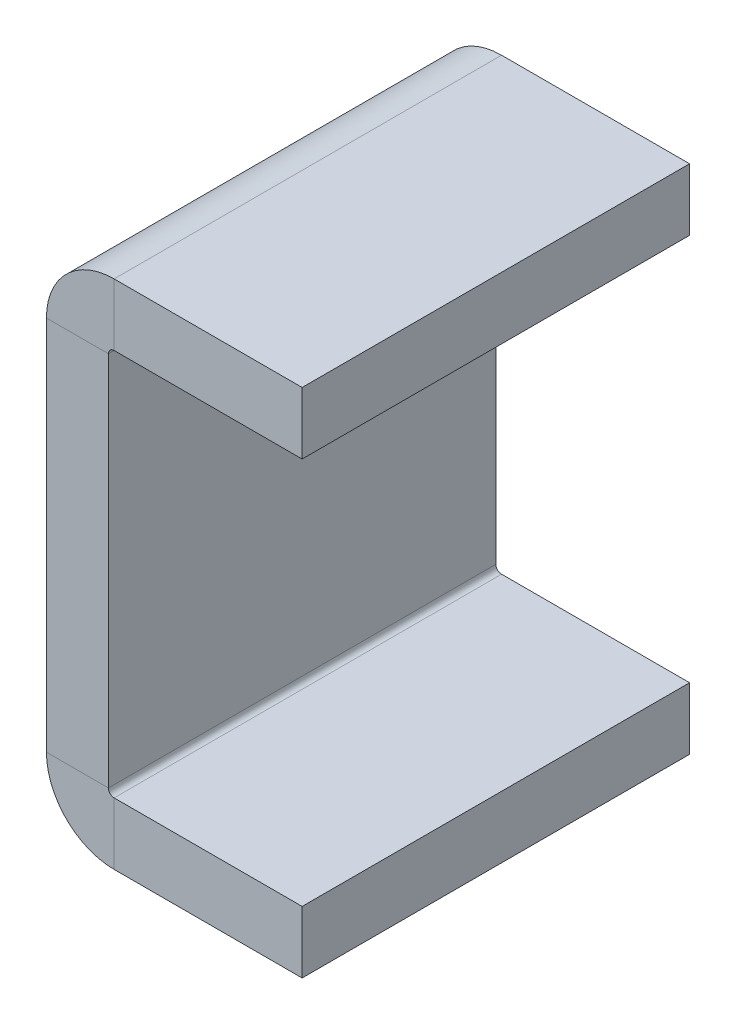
ISO-10303-21;
HEADER;
FILE_DESCRIPTION(('STEP AP214'),'2;1');
FILE_NAME('part.step','',(''),(''),'','','');
FILE_SCHEMA(('AUTOMOTIVE_DESIGN { 1 0 10303 214 1 1 1 1 }'));
ENDSEC;
DATA;
#1=APPLICATION_CONTEXT('core data for automotive mechanical design processes');
#2=APPLICATION_PROTOCOL_DEFINITION('international standard','automotive_design',2000,#1);
#3=PRODUCT_CONTEXT('',#1,'mechanical');
#4=PRODUCT('Part','Part','',(#3));
#5=PRODUCT_RELATED_PRODUCT_CATEGORY('part','',(#4));
#6=PRODUCT_DEFINITION_FORMATION('','',#4);
#7=PRODUCT_DEFINITION_CONTEXT('part definition',#1,'design');
#8=PRODUCT_DEFINITION('design','',#6,#7);
#9=PRODUCT_DEFINITION_SHAPE('','',#8);
#10=(LENGTH_UNIT() NAMED_UNIT(*) SI_UNIT(.MILLI.,.METRE.));
#11=(NAMED_UNIT(*) PLANE_ANGLE_UNIT() SI_UNIT($,.RADIAN.));
#12=(NAMED_UNIT(*) SI_UNIT($,.STERADIAN.) SOLID_ANGLE_UNIT());
#13=UNCERTAINTY_MEASURE_WITH_UNIT(LENGTH_MEASURE(1.E-05),#10,'distance_accuracy_value','');
#14=(GEOMETRIC_REPRESENTATION_CONTEXT(3) GLOBAL_UNCERTAINTY_ASSIGNED_CONTEXT((#13)) GLOBAL_UNIT_ASSIGNED_CONTEXT((#10,
#11,#12)) REPRESENTATION_CONTEXT('',''));
#15=CARTESIAN_POINT('',(0.,0.,0.));
#16=DIRECTION('',(0.,0.,1.));
#17=DIRECTION('',(1.,0.,0.));
#18=AXIS2_PLACEMENT_3D('',#15,#16,#17);
#19=CARTESIAN_POINT('',(0.,-0.7366,50.));
#20=DIRECTION('',(0.,0.,1.));
#21=DIRECTION('',(1.,0.,0.));
#22=AXIS2_PLACEMENT_3D('',#19,#20,#21);
#23=PLANE('',#22);
#24=DIRECTION('',(-1.,0.,0.));
#25=VECTOR('',#24,1.);
#26=CARTESIAN_POINT('',(0.,-0.7366,50.));
#27=LINE('',#26,#25);
#28=CARTESIAN_POINT('',(0.,-0.7366,50.));
#29=VERTEX_POINT('',#28);
#30=CARTESIAN_POINT('',(-8.,-0.736600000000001,50.));
#31=VERTEX_POINT('',#30);
#32=EDGE_CURVE('E11',#29,#31,#27,.T.);
#33=ORIENTED_EDGE('',*,*,#32,.F.);
#34=CARTESIAN_POINT('',(0.7366,-0.7366,50.));
#35=DIRECTION('',(0.,0.,-1.));
#36=DIRECTION('',(-1.,0.,0.));
#37=AXIS2_PLACEMENT_3D('',#34,#35,#36);
#38=CIRCLE('',#37,0.7366);
#39=CARTESIAN_POINT('',(0.7366,0.,50.));
#40=VERTEX_POINT('',#39);
#41=EDGE_CURVE('E251',#40,#29,#38,.F.);
#42=ORIENTED_EDGE('',*,*,#41,.F.);
#43=DIRECTION('',(0.,-1.,0.));
#44=VECTOR('',#43,1.);
#45=CARTESIAN_POINT('',(0.736600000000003,8.,50.));
#46=LINE('',#45,#44);
#47=CARTESIAN_POINT('',(0.736600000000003,8.,50.));
#48=VERTEX_POINT('',#47);
#49=EDGE_CURVE('E49',#48,#40,#46,.T.);
#50=ORIENTED_EDGE('',*,*,#49,.F.);
#51=CARTESIAN_POINT('',(0.7366,-0.7366,50.));
#52=DIRECTION('',(0.,0.,1.));
#53=DIRECTION('',(1.,0.,0.));
#54=AXIS2_PLACEMENT_3D('',#51,#52,#53);
#55=CIRCLE('',#54,8.7366);
#56=EDGE_CURVE('E150',#48,#31,#55,.T.);
#57=ORIENTED_EDGE('',*,*,#56,.T.);
#58=EDGE_LOOP('',(#33,#42,#50,#57));
#59=FACE_BOUND('',#58,.T.);
#60=ADVANCED_FACE('F41',(#59),#23,.T.);
#61=CARTESIAN_POINT('',(0.736600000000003,8.,50.));
#62=DIRECTION('',(0.,0.,1.));
#63=DIRECTION('',(1.,0.,0.));
#64=AXIS2_PLACEMENT_3D('',#61,#62,#63);
#65=PLANE('',#64);
#66=DIRECTION('',(0.,-1.,0.));
#67=VECTOR('',#66,1.);
#68=CARTESIAN_POINT('',(0.,0.,50.));
#69=LINE('',#68,#67);
#70=CARTESIAN_POINT('',(0.,-49.2634,50.));
#71=VERTEX_POINT('',#70);
#72=EDGE_CURVE('E144',#29,#71,#69,.T.);
#73=ORIENTED_EDGE('',*,*,#72,.F.);
#74=ORIENTED_EDGE('',*,*,#32,.T.);
#75=DIRECTION('',(0.,-1.,0.));
#76=VECTOR('',#75,1.);
#77=CARTESIAN_POINT('',(-8.,0.,50.));
#78=LINE('',#77,#76);
#79=CARTESIAN_POINT('',(-7.99999999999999,-49.2634,50.));
#80=VERTEX_POINT('',#79);
#81=EDGE_CURVE('E141',#31,#80,#78,.T.);
#82=ORIENTED_EDGE('',*,*,#81,.T.);
#83=DIRECTION('',(1.,0.,0.));
#84=VECTOR('',#83,1.);
#85=CARTESIAN_POINT('',(-7.99999999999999,-49.2634,50.));
#86=LINE('',#85,#84);
#87=EDGE_CURVE('E232',#80,#71,#86,.T.);
#88=ORIENTED_EDGE('',*,*,#87,.T.);
#89=EDGE_LOOP('',(#73,#74,#82,#88));
#90=FACE_BOUND('',#89,.T.);
#91=ADVANCED_FACE('F139',(#90),#65,.T.);
#92=CARTESIAN_POINT('',(0.7366,0.,0.));
#93=DIRECTION('',(0.,0.,-1.));
#94=DIRECTION('',(-1.,0.,0.));
#95=AXIS2_PLACEMENT_3D('',#92,#93,#94);
#96=PLANE('',#95);
#97=DIRECTION('',(0.,1.,0.));
#98=VECTOR('',#97,1.);
#99=CARTESIAN_POINT('',(0.7366,0.,0.));
#100=LINE('',#99,#98);
#101=CARTESIAN_POINT('',(0.7366,0.,0.));
#102=VERTEX_POINT('',#101);
#103=CARTESIAN_POINT('',(0.736600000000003,8.,0.));
#104=VERTEX_POINT('',#103);
#105=EDGE_CURVE('E237',#102,#104,#100,.T.);
#106=ORIENTED_EDGE('',*,*,#105,.F.);
#107=CARTESIAN_POINT('',(0.7366,-0.7366,0.));
#108=DIRECTION('',(0.,0.,-1.));
#109=DIRECTION('',(-1.,0.,0.));
#110=AXIS2_PLACEMENT_3D('',#107,#108,#109);
#111=CIRCLE('',#110,0.7366);
#112=CARTESIAN_POINT('',(0.,-0.7366,0.));
#113=VERTEX_POINT('',#112);
#114=EDGE_CURVE('E189',#102,#113,#111,.F.);
#115=ORIENTED_EDGE('',*,*,#114,.T.);
#116=DIRECTION('',(1.,0.,0.));
#117=VECTOR('',#116,1.);
#118=CARTESIAN_POINT('',(-8.,-0.736600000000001,0.));
#119=LINE('',#118,#117);
#120=CARTESIAN_POINT('',(-8.,-0.736600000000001,0.));
#121=VERTEX_POINT('',#120);
#122=EDGE_CURVE('E235',#121,#113,#119,.T.);
#123=ORIENTED_EDGE('',*,*,#122,.F.);
#124=CARTESIAN_POINT('',(0.7366,-0.7366,0.));
#125=DIRECTION('',(0.,0.,1.));
#126=DIRECTION('',(1.,0.,0.));
#127=AXIS2_PLACEMENT_3D('',#124,#125,#126);
#128=CIRCLE('',#127,8.7366);
#129=EDGE_CURVE('E162',#104,#121,#128,.T.);
#130=ORIENTED_EDGE('',*,*,#129,.F.);
#131=EDGE_LOOP('',(#106,#115,#123,#130));
#132=FACE_BOUND('',#131,.T.);
#133=ADVANCED_FACE('F289',(#132),#96,.T.);
#134=CARTESIAN_POINT('',(-8.,-0.736600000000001,0.));
#135=DIRECTION('',(0.,0.,-1.));
#136=DIRECTION('',(-1.,0.,0.));
#137=AXIS2_PLACEMENT_3D('',#134,#135,#136);
#138=PLANE('',#137);
#139=DIRECTION('',(-1.,0.,0.));
#140=VECTOR('',#139,1.);
#141=CARTESIAN_POINT('',(25.,0.,0.));
#142=LINE('',#141,#140);
#143=CARTESIAN_POINT('',(25.,0.,0.));
#144=VERTEX_POINT('',#143);
#145=EDGE_CURVE('E192',#144,#102,#142,.T.);
#146=ORIENTED_EDGE('',*,*,#145,.T.);
#147=ORIENTED_EDGE('',*,*,#105,.T.);
#148=DIRECTION('',(-1.,0.,0.));
#149=VECTOR('',#148,1.);
#150=CARTESIAN_POINT('',(25.,8.,0.));
#151=LINE('',#150,#149);
#152=CARTESIAN_POINT('',(25.,8.,0.));
#153=VERTEX_POINT('',#152);
#154=EDGE_CURVE('E198',#153,#104,#151,.T.);
#155=ORIENTED_EDGE('',*,*,#154,.F.);
#156=DIRECTION('',(0.,-1.,0.));
#157=VECTOR('',#156,1.);
#158=CARTESIAN_POINT('',(25.,8.,0.));
#159=LINE('',#158,#157);
#160=EDGE_CURVE('E195',#153,#144,#159,.T.);
#161=ORIENTED_EDGE('',*,*,#160,.T.);
#162=EDGE_LOOP('',(#146,#147,#155,#161));
#163=FACE_BOUND('',#162,.T.);
#164=ADVANCED_FACE('F292',(#163),#138,.T.);
#165=CARTESIAN_POINT('',(0.736600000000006,-50.,50.));
#166=DIRECTION('',(0.,0.,1.));
#167=DIRECTION('',(1.,0.,0.));
#168=AXIS2_PLACEMENT_3D('',#165,#166,#167);
#169=PLANE('',#168);
#170=DIRECTION('',(0.,-1.,0.));
#171=VECTOR('',#170,1.);
#172=CARTESIAN_POINT('',(0.736600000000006,-50.,50.));
#173=LINE('',#172,#171);
#174=CARTESIAN_POINT('',(0.736600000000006,-50.,50.));
#175=VERTEX_POINT('',#174);
#176=CARTESIAN_POINT('',(0.736600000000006,-58.,50.));
#177=VERTEX_POINT('',#176);
#178=EDGE_CURVE('E57',#175,#177,#173,.T.);
#179=ORIENTED_EDGE('',*,*,#178,.F.);
#180=CARTESIAN_POINT('',(0.736600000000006,-49.2634,50.));
#181=DIRECTION('',(0.,0.,-1.));
#182=DIRECTION('',(-1.,0.,0.));
#183=AXIS2_PLACEMENT_3D('',#180,#181,#182);
#184=CIRCLE('',#183,0.7366);
#185=EDGE_CURVE('E261',#71,#175,#184,.F.);
#186=ORIENTED_EDGE('',*,*,#185,.F.);
#187=ORIENTED_EDGE('',*,*,#87,.F.);
#188=CARTESIAN_POINT('',(0.736600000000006,-49.2634,50.));
#189=DIRECTION('',(0.,0.,1.));
#190=DIRECTION('',(1.,0.,0.));
#191=AXIS2_PLACEMENT_3D('',#188,#189,#190);
#192=CIRCLE('',#191,8.7366);
#193=EDGE_CURVE('E170',#80,#177,#192,.T.);
#194=ORIENTED_EDGE('',*,*,#193,.T.);
#195=EDGE_LOOP('',(#179,#186,#187,#194));
#196=FACE_BOUND('',#195,.T.);
#197=ADVANCED_FACE('F284',(#196),#169,.T.);
#198=CARTESIAN_POINT('',(-7.99999999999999,-49.2634,50.));
#199=DIRECTION('',(0.,0.,1.));
#200=DIRECTION('',(1.,0.,0.));
#201=AXIS2_PLACEMENT_3D('',#198,#199,#200);
#202=PLANE('',#201);
#203=DIRECTION('',(1.,0.,0.));
#204=VECTOR('',#203,1.);
#205=CARTESIAN_POINT('',(0.,-50.,50.));
#206=LINE('',#205,#204);
#207=CARTESIAN_POINT('',(25.,-50.,50.));
#208=VERTEX_POINT('',#207);
#209=EDGE_CURVE('E264',#175,#208,#206,.T.);
#210=ORIENTED_EDGE('',*,*,#209,.F.);
#211=ORIENTED_EDGE('',*,*,#178,.T.);
#212=DIRECTION('',(1.,0.,0.));
#213=VECTOR('',#212,1.);
#214=CARTESIAN_POINT('',(0.,-58.,50.));
#215=LINE('',#214,#213);
#216=CARTESIAN_POINT('',(25.,-58.,50.));
#217=VERTEX_POINT('',#216);
#218=EDGE_CURVE('E111',#177,#217,#215,.T.);
#219=ORIENTED_EDGE('',*,*,#218,.T.);
#220=DIRECTION('',(0.,-1.,0.));
#221=VECTOR('',#220,1.);
#222=CARTESIAN_POINT('',(25.,-50.,50.));
#223=LINE('',#222,#221);
#224=EDGE_CURVE('E267',#208,#217,#223,.T.);
#225=ORIENTED_EDGE('',*,*,#224,.F.);
#226=EDGE_LOOP('',(#210,#211,#219,#225));
#227=FACE_BOUND('',#226,.T.);
#228=ADVANCED_FACE('F273',(#227),#202,.T.);
#229=CARTESIAN_POINT('',(0.,-49.2634,0.));
#230=DIRECTION('',(0.,0.,-1.));
#231=DIRECTION('',(-1.,0.,0.));
#232=AXIS2_PLACEMENT_3D('',#229,#230,#231);
#233=PLANE('',#232);
#234=DIRECTION('',(-1.,0.,0.));
#235=VECTOR('',#234,1.);
#236=CARTESIAN_POINT('',(0.,-49.2634,0.));
#237=LINE('',#236,#235);
#238=CARTESIAN_POINT('',(0.,-49.2634,0.));
#239=VERTEX_POINT('',#238);
#240=CARTESIAN_POINT('',(-7.99999999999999,-49.2634,0.));
#241=VERTEX_POINT('',#240);
#242=EDGE_CURVE('E98',#239,#241,#237,.T.);
#243=ORIENTED_EDGE('',*,*,#242,.F.);
#244=CARTESIAN_POINT('',(0.736600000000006,-49.2634,0.));
#245=DIRECTION('',(0.,0.,-1.));
#246=DIRECTION('',(-1.,0.,0.));
#247=AXIS2_PLACEMENT_3D('',#244,#245,#246);
#248=CIRCLE('',#247,0.7366);
#249=CARTESIAN_POINT('',(0.736600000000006,-50.,0.));
#250=VERTEX_POINT('',#249);
#251=EDGE_CURVE('E185',#239,#250,#248,.F.);
#252=ORIENTED_EDGE('',*,*,#251,.T.);
#253=DIRECTION('',(0.,1.,0.));
#254=VECTOR('',#253,1.);
#255=CARTESIAN_POINT('',(0.736600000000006,-58.,0.));
#256=LINE('',#255,#254);
#257=CARTESIAN_POINT('',(0.736600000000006,-58.,0.));
#258=VERTEX_POINT('',#257);
#259=EDGE_CURVE('E105',#258,#250,#256,.T.);
#260=ORIENTED_EDGE('',*,*,#259,.F.);
#261=CARTESIAN_POINT('',(0.736600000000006,-49.2634,0.));
#262=DIRECTION('',(0.,0.,1.));
#263=DIRECTION('',(1.,0.,0.));
#264=AXIS2_PLACEMENT_3D('',#261,#262,#263);
#265=CIRCLE('',#264,8.7366);
#266=EDGE_CURVE('E204',#241,#258,#265,.T.);
#267=ORIENTED_EDGE('',*,*,#266,.F.);
#268=EDGE_LOOP('',(#243,#252,#260,#267));
#269=FACE_BOUND('',#268,.T.);
#270=ADVANCED_FACE('F321',(#269),#233,.T.);
#271=CARTESIAN_POINT('',(0.736600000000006,-58.,0.));
#272=DIRECTION('',(0.,0.,-1.));
#273=DIRECTION('',(-1.,0.,0.));
#274=AXIS2_PLACEMENT_3D('',#271,#272,#273);
#275=PLANE('',#274);
#276=DIRECTION('',(0.,-1.,0.));
#277=VECTOR('',#276,1.);
#278=CARTESIAN_POINT('',(0.,0.,0.));
#279=LINE('',#278,#277);
#280=EDGE_CURVE('E187',#113,#239,#279,.T.);
#281=ORIENTED_EDGE('',*,*,#280,.T.);
#282=ORIENTED_EDGE('',*,*,#242,.T.);
#283=DIRECTION('',(0.,-1.,0.));
#284=VECTOR('',#283,1.);
#285=CARTESIAN_POINT('',(-8.,0.,0.));
#286=LINE('',#285,#284);
#287=EDGE_CURVE('E202',#121,#241,#286,.T.);
#288=ORIENTED_EDGE('',*,*,#287,.F.);
#289=ORIENTED_EDGE('',*,*,#122,.T.);
#290=EDGE_LOOP('',(#281,#282,#288,#289));
#291=FACE_BOUND('',#290,.T.);
#292=ADVANCED_FACE('F324',(#291),#275,.T.);
#293=CARTESIAN_POINT('',(0.,-58.,50.));
#294=DIRECTION('',(0.,1.,0.));
#295=DIRECTION('',(0.,0.,1.));
#296=AXIS2_PLACEMENT_3D('',#293,#294,#295);
#297=PLANE('',#296);
#298=DIRECTION('',(1.,0.,0.));
#299=VECTOR('',#298,1.);
#300=CARTESIAN_POINT('',(0.,-58.,0.));
#301=LINE('',#300,#299);
#302=CARTESIAN_POINT('',(25.,-58.,0.));
#303=VERTEX_POINT('',#302);
#304=EDGE_CURVE('E176',#258,#303,#301,.T.);
#305=ORIENTED_EDGE('',*,*,#304,.T.);
#306=DIRECTION('',(0.,0.,-1.));
#307=VECTOR('',#306,1.);
#308=CARTESIAN_POINT('',(25.,-58.,50.));
#309=LINE('',#308,#307);
#310=EDGE_CURVE('E228',#217,#303,#309,.T.);
#311=ORIENTED_EDGE('',*,*,#310,.F.);
#312=ORIENTED_EDGE('',*,*,#218,.F.);
#313=DIRECTION('',(0.,0.,-1.));
#314=VECTOR('',#313,1.);
#315=CARTESIAN_POINT('',(0.736600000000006,-58.,50.));
#316=LINE('',#315,#314);
#317=EDGE_CURVE('E172',#177,#258,#316,.T.);
#318=ORIENTED_EDGE('',*,*,#317,.T.);
#319=EDGE_LOOP('',(#305,#311,#312,#318));
#320=FACE_BOUND('',#319,.T.);
#321=ADVANCED_FACE('F327',(#320),#297,.F.);
#322=CARTESIAN_POINT('',(25.,-50.,50.));
#323=DIRECTION('',(1.,0.,0.));
#324=DIRECTION('',(0.,0.,-1.));
#325=AXIS2_PLACEMENT_3D('',#322,#323,#324);
#326=PLANE('',#325);
#327=DIRECTION('',(0.,-1.,0.));
#328=VECTOR('',#327,1.);
#329=CARTESIAN_POINT('',(25.,-50.,0.));
#330=LINE('',#329,#328);
#331=CARTESIAN_POINT('',(25.,-50.,0.));
#332=VERTEX_POINT('',#331);
#333=EDGE_CURVE('E179',#332,#303,#330,.T.);
#334=ORIENTED_EDGE('',*,*,#333,.F.);
#335=DIRECTION('',(0.,0.,-1.));
#336=VECTOR('',#335,1.);
#337=CARTESIAN_POINT('',(25.,-50.,50.));
#338=LINE('',#337,#336);
#339=EDGE_CURVE('E226',#208,#332,#338,.T.);
#340=ORIENTED_EDGE('',*,*,#339,.F.);
#341=ORIENTED_EDGE('',*,*,#224,.T.);
#342=ORIENTED_EDGE('',*,*,#310,.T.);
#343=EDGE_LOOP('',(#334,#340,#341,#342));
#344=FACE_BOUND('',#343,.T.);
#345=ADVANCED_FACE('F272',(#344),#326,.T.);
#346=CARTESIAN_POINT('',(0.,-50.,50.));
#347=DIRECTION('',(0.,1.,0.));
#348=DIRECTION('',(0.,0.,1.));
#349=AXIS2_PLACEMENT_3D('',#346,#347,#348);
#350=PLANE('',#349);
#351=DIRECTION('',(1.,0.,0.));
#352=VECTOR('',#351,1.);
#353=CARTESIAN_POINT('',(0.,-50.,0.));
#354=LINE('',#353,#352);
#355=EDGE_CURVE('E182',#250,#332,#354,.T.);
#356=ORIENTED_EDGE('',*,*,#355,.F.);
#357=DIRECTION('',(0.,0.,-1.));
#358=VECTOR('',#357,1.);
#359=CARTESIAN_POINT('',(0.736600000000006,-50.,50.));
#360=LINE('',#359,#358);
#361=EDGE_CURVE('E223',#175,#250,#360,.T.);
#362=ORIENTED_EDGE('',*,*,#361,.F.);
#363=ORIENTED_EDGE('',*,*,#209,.T.);
#364=ORIENTED_EDGE('',*,*,#339,.T.);
#365=EDGE_LOOP('',(#356,#362,#363,#364));
#366=FACE_BOUND('',#365,.T.);
#367=ADVANCED_FACE('F277',(#366),#350,.T.);
#368=CARTESIAN_POINT('',(0.736600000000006,-49.2634,50.));
#369=DIRECTION('',(0.,0.,-1.));
#370=DIRECTION('',(-1.,0.,0.));
#371=AXIS2_PLACEMENT_3D('',#368,#369,#370);
#372=CYLINDRICAL_SURFACE('',#371,0.7366);
#373=ORIENTED_EDGE('',*,*,#251,.F.);
#374=DIRECTION('',(0.,0.,-1.));
#375=VECTOR('',#374,1.);
#376=CARTESIAN_POINT('',(0.,-49.2634,50.));
#377=LINE('',#376,#375);
#378=EDGE_CURVE('E220',#71,#239,#377,.T.);
#379=ORIENTED_EDGE('',*,*,#378,.F.);
#380=ORIENTED_EDGE('',*,*,#185,.T.);
#381=ORIENTED_EDGE('',*,*,#361,.T.);
#382=EDGE_LOOP('',(#373,#379,#380,#381));
#383=FACE_BOUND('',#382,.T.);
#384=ADVANCED_FACE('F280',(#383),#372,.F.);
#385=CARTESIAN_POINT('',(0.,0.,50.));
#386=DIRECTION('',(1.,0.,0.));
#387=DIRECTION('',(0.,1.,0.));
#388=AXIS2_PLACEMENT_3D('',#385,#386,#387);
#389=PLANE('',#388);
#390=ORIENTED_EDGE('',*,*,#280,.F.);
#391=DIRECTION('',(0.,0.,-1.));
#392=VECTOR('',#391,1.);
#393=CARTESIAN_POINT('',(0.,-0.7366,50.));
#394=LINE('',#393,#392);
#395=EDGE_CURVE('E217',#29,#113,#394,.T.);
#396=ORIENTED_EDGE('',*,*,#395,.F.);
#397=ORIENTED_EDGE('',*,*,#72,.T.);
#398=ORIENTED_EDGE('',*,*,#378,.T.);
#399=EDGE_LOOP('',(#390,#396,#397,#398));
#400=FACE_BOUND('',#399,.T.);
#401=ADVANCED_FACE('F287',(#400),#389,.T.);
#402=CARTESIAN_POINT('',(0.7366,-0.7366,50.));
#403=DIRECTION('',(0.,0.,-1.));
#404=DIRECTION('',(-1.,0.,0.));
#405=AXIS2_PLACEMENT_3D('',#402,#403,#404);
#406=CYLINDRICAL_SURFACE('',#405,0.7366);
#407=ORIENTED_EDGE('',*,*,#114,.F.);
#408=DIRECTION('',(0.,0.,-1.));
#409=VECTOR('',#408,1.);
#410=CARTESIAN_POINT('',(0.7366,0.,50.));
#411=LINE('',#410,#409);
#412=EDGE_CURVE('E214',#40,#102,#411,.T.);
#413=ORIENTED_EDGE('',*,*,#412,.F.);
#414=ORIENTED_EDGE('',*,*,#41,.T.);
#415=ORIENTED_EDGE('',*,*,#395,.T.);
#416=EDGE_LOOP('',(#407,#413,#414,#415));
#417=FACE_BOUND('',#416,.T.);
#418=ADVANCED_FACE('F250',(#417),#406,.F.);
#419=CARTESIAN_POINT('',(25.,0.,50.));
#420=DIRECTION('',(0.,-1.,0.));
#421=DIRECTION('',(1.,0.,0.));
#422=AXIS2_PLACEMENT_3D('',#419,#420,#421);
#423=PLANE('',#422);
#424=ORIENTED_EDGE('',*,*,#145,.F.);
#425=DIRECTION('',(0.,0.,-1.));
#426=VECTOR('',#425,1.);
#427=CARTESIAN_POINT('',(25.,0.,50.));
#428=LINE('',#427,#426);
#429=CARTESIAN_POINT('',(25.,0.,50.));
#430=VERTEX_POINT('',#429);
#431=EDGE_CURVE('E212',#430,#144,#428,.T.);
#432=ORIENTED_EDGE('',*,*,#431,.F.);
#433=DIRECTION('',(-1.,0.,0.));
#434=VECTOR('',#433,1.);
#435=CARTESIAN_POINT('',(25.,0.,50.));
#436=LINE('',#435,#434);
#437=EDGE_CURVE('E244',#430,#40,#436,.T.);
#438=ORIENTED_EDGE('',*,*,#437,.T.);
#439=ORIENTED_EDGE('',*,*,#412,.T.);
#440=EDGE_LOOP('',(#424,#432,#438,#439));
#441=FACE_BOUND('',#440,.T.);
#442=ADVANCED_FACE('F255',(#441),#423,.T.);
#443=CARTESIAN_POINT('',(25.,8.,50.));
#444=DIRECTION('',(1.,0.,0.));
#445=DIRECTION('',(0.,0.,-1.));
#446=AXIS2_PLACEMENT_3D('',#443,#444,#445);
#447=PLANE('',#446);
#448=ORIENTED_EDGE('',*,*,#160,.F.);
#449=DIRECTION('',(0.,0.,-1.));
#450=VECTOR('',#449,1.);
#451=CARTESIAN_POINT('',(25.,8.,50.));
#452=LINE('',#451,#450);
#453=CARTESIAN_POINT('',(25.,8.,50.));
#454=VERTEX_POINT('',#453);
#455=EDGE_CURVE('E210',#454,#153,#452,.T.);
#456=ORIENTED_EDGE('',*,*,#455,.F.);
#457=DIRECTION('',(0.,-1.,0.));
#458=VECTOR('',#457,1.);
#459=CARTESIAN_POINT('',(25.,8.,50.));
#460=LINE('',#459,#458);
#461=EDGE_CURVE('E256',#454,#430,#460,.T.);
#462=ORIENTED_EDGE('',*,*,#461,.T.);
#463=ORIENTED_EDGE('',*,*,#431,.T.);
#464=EDGE_LOOP('',(#448,#456,#462,#463));
#465=FACE_BOUND('',#464,.T.);
#466=ADVANCED_FACE('F297',(#465),#447,.T.);
#467=CARTESIAN_POINT('',(25.,8.,50.));
#468=DIRECTION('',(0.,-1.,0.));
#469=DIRECTION('',(1.,0.,0.));
#470=AXIS2_PLACEMENT_3D('',#467,#468,#469);
#471=PLANE('',#470);
#472=ORIENTED_EDGE('',*,*,#154,.T.);
#473=DIRECTION('',(0.,0.,-1.));
#474=VECTOR('',#473,1.);
#475=CARTESIAN_POINT('',(0.736600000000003,8.,50.));
#476=LINE('',#475,#474);
#477=EDGE_CURVE('E164',#48,#104,#476,.T.);
#478=ORIENTED_EDGE('',*,*,#477,.F.);
#479=DIRECTION('',(-1.,0.,0.));
#480=VECTOR('',#479,1.);
#481=CARTESIAN_POINT('',(25.,8.,50.));
#482=LINE('',#481,#480);
#483=EDGE_CURVE('E155',#454,#48,#482,.T.);
#484=ORIENTED_EDGE('',*,*,#483,.F.);
#485=ORIENTED_EDGE('',*,*,#455,.T.);
#486=EDGE_LOOP('',(#472,#478,#484,#485));
#487=FACE_BOUND('',#486,.T.);
#488=ADVANCED_FACE('F295',(#487),#471,.F.);
#489=CARTESIAN_POINT('',(0.7366,-0.7366,50.));
#490=DIRECTION('',(0.,0.,-1.));
#491=DIRECTION('',(-1.,0.,0.));
#492=AXIS2_PLACEMENT_3D('',#489,#490,#491);
#493=CYLINDRICAL_SURFACE('',#492,8.7366);
#494=ORIENTED_EDGE('',*,*,#129,.T.);
#495=DIRECTION('',(0.,0.,-1.));
#496=VECTOR('',#495,1.);
#497=CARTESIAN_POINT('',(-8.,-0.736600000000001,50.));
#498=LINE('',#497,#496);
#499=EDGE_CURVE('E159',#31,#121,#498,.T.);
#500=ORIENTED_EDGE('',*,*,#499,.F.);
#501=ORIENTED_EDGE('',*,*,#56,.F.);
#502=ORIENTED_EDGE('',*,*,#477,.T.);
#503=EDGE_LOOP('',(#494,#500,#501,#502));
#504=FACE_BOUND('',#503,.T.);
#505=ADVANCED_FACE('F160',(#504),#493,.T.);
#506=CARTESIAN_POINT('',(-8.,0.,50.));
#507=DIRECTION('',(1.,0.,0.));
#508=DIRECTION('',(0.,1.,0.));
#509=AXIS2_PLACEMENT_3D('',#506,#507,#508);
#510=PLANE('',#509);
#511=ORIENTED_EDGE('',*,*,#287,.T.);
#512=DIRECTION('',(0.,0.,-1.));
#513=VECTOR('',#512,1.);
#514=CARTESIAN_POINT('',(-7.99999999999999,-49.2634,50.));
#515=LINE('',#514,#513);
#516=EDGE_CURVE('E165',#80,#241,#515,.T.);
#517=ORIENTED_EDGE('',*,*,#516,.F.);
#518=ORIENTED_EDGE('',*,*,#81,.F.);
#519=ORIENTED_EDGE('',*,*,#499,.T.);
#520=EDGE_LOOP('',(#511,#517,#518,#519));
#521=FACE_BOUND('',#520,.T.);
#522=ADVANCED_FACE('F167',(#521),#510,.F.);
#523=CARTESIAN_POINT('',(0.736600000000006,-49.2634,50.));
#524=DIRECTION('',(0.,0.,-1.));
#525=DIRECTION('',(-1.,0.,0.));
#526=AXIS2_PLACEMENT_3D('',#523,#524,#525);
#527=CYLINDRICAL_SURFACE('',#526,8.7366);
#528=ORIENTED_EDGE('',*,*,#266,.T.);
#529=ORIENTED_EDGE('',*,*,#317,.F.);
#530=ORIENTED_EDGE('',*,*,#193,.F.);
#531=ORIENTED_EDGE('',*,*,#516,.T.);
#532=EDGE_LOOP('',(#528,#529,#530,#531));
#533=FACE_BOUND('',#532,.T.);
#534=ADVANCED_FACE('F379',(#533),#527,.T.);
#535=CARTESIAN_POINT('',(0.736600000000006,-49.2634,50.));
#536=DIRECTION('',(0.,0.,-1.));
#537=DIRECTION('',(-1.,0.,0.));
#538=AXIS2_PLACEMENT_3D('',#535,#536,#537);
#539=PLANE('',#538);
#540=ORIENTED_EDGE('',*,*,#483,.T.);
#541=ORIENTED_EDGE('',*,*,#49,.T.);
#542=ORIENTED_EDGE('',*,*,#437,.F.);
#543=ORIENTED_EDGE('',*,*,#461,.F.);
#544=EDGE_LOOP('',(#540,#541,#542,#543));
#545=FACE_BOUND('',#544,.T.);
#546=ADVANCED_FACE('F241',(#545),#539,.F.);
#547=CARTESIAN_POINT('',(0.736600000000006,-49.2634,0.));
#548=DIRECTION('',(0.,0.,-1.));
#549=DIRECTION('',(-1.,0.,0.));
#550=AXIS2_PLACEMENT_3D('',#547,#548,#549);
#551=PLANE('',#550);
#552=ORIENTED_EDGE('',*,*,#304,.F.);
#553=ORIENTED_EDGE('',*,*,#259,.T.);
#554=ORIENTED_EDGE('',*,*,#355,.T.);
#555=ORIENTED_EDGE('',*,*,#333,.T.);
#556=EDGE_LOOP('',(#552,#553,#554,#555));
#557=FACE_BOUND('',#556,.T.);
#558=ADVANCED_FACE('F399',(#557),#551,.T.);
#559=CLOSED_SHELL('',(#60,#91,#133,#164,#197,#228,#270,#292,#321,#345,#367,#384,#401,#418,#442,
#466,#488,#505,#522,#534,#546,#558));
#560=MANIFOLD_SOLID_BREP('B2',#559);
#561=ADVANCED_BREP_SHAPE_REPRESENTATION('',(#18,#560),#14);
#562=SHAPE_DEFINITION_REPRESENTATION(#9,#561);
ENDSEC;
END-ISO-10303-21;
